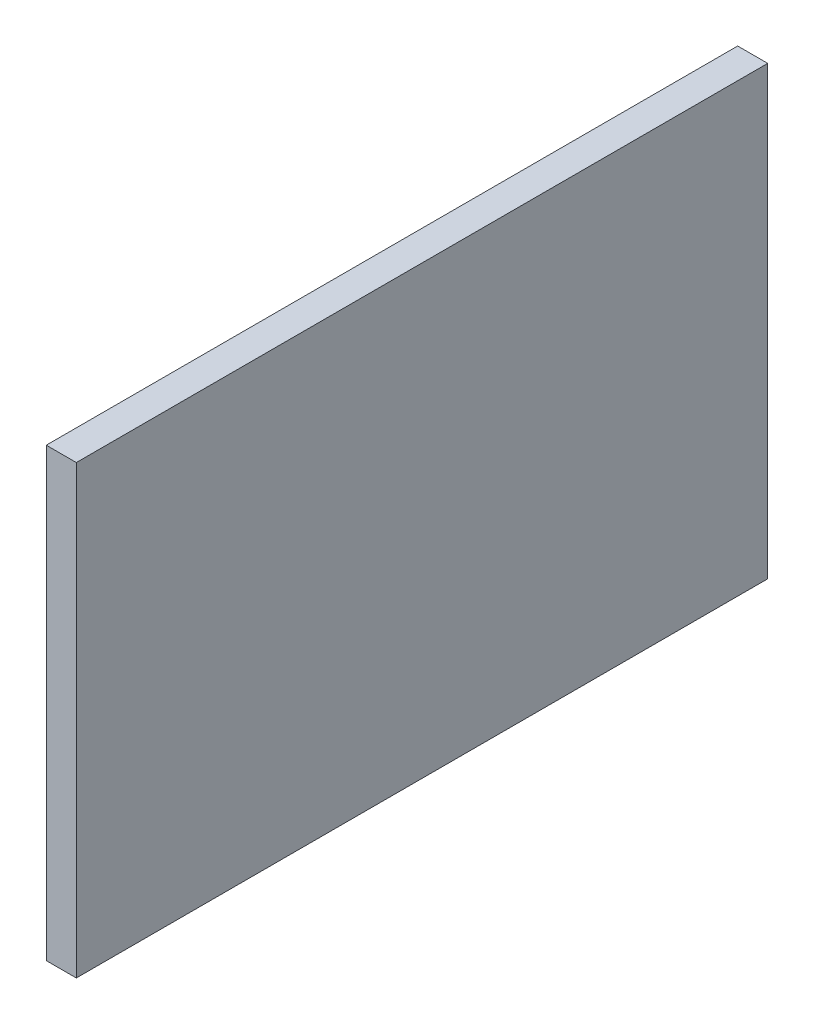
from build123d import *

# Parameters (mm, degrees)
CROQUIS1_W              = 920
CROQUIS1_H              = 594
SALIENTE_EXTRUIR1_DEPTH = 40


with BuildPart() as part:
    # Croquis1 → Saliente-Extruir1 (new body)
    with BuildSketch(Plane(origin=(0, 0, 0), x_dir=(0, 0, -1), z_dir=(1, 0, 0))):
        with Locations((460, 297)):
            Rectangle(CROQUIS1_W, CROQUIS1_H)
    extrude(amount=SALIENTE_EXTRUIR1_DEPTH)


solid = part.part
